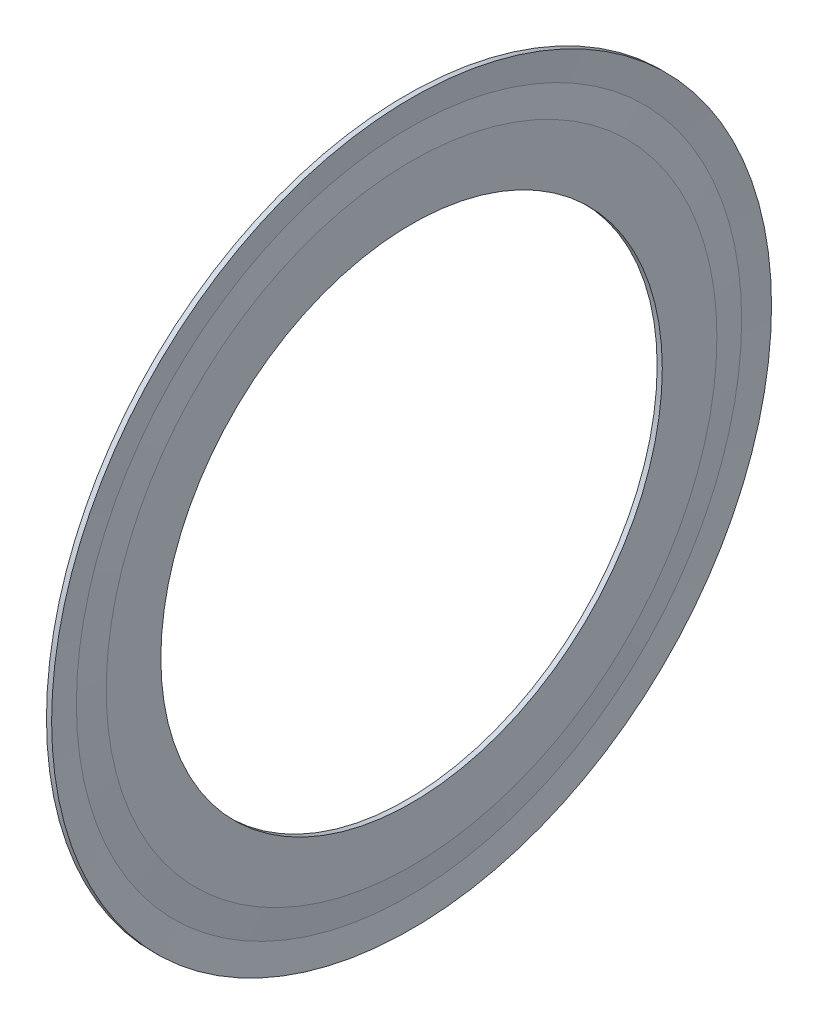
from build123d import *


with BuildPart() as part:
    # Sketch1 → Revolve1 (revolve)
    with BuildSketch(Plane.XY, mode=Mode.PRIVATE) as revolve1_sk:
        Polygon((4.483, 6.685392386), (4.483, 6.15), (4.5865, 5.05), (4.69, 5.05), (4.69, 6.15), (4.63825, 6.7), (4.69, 7.25), (4.5865, 7.25), align=None)
    revolve(revolve1_sk.sketch.rotate(Axis((50, 0, 0), (-1, 0, 0)), 90), axis=Axis((50, 0, 0), (-1, 0, 0)))


solid = part.part
